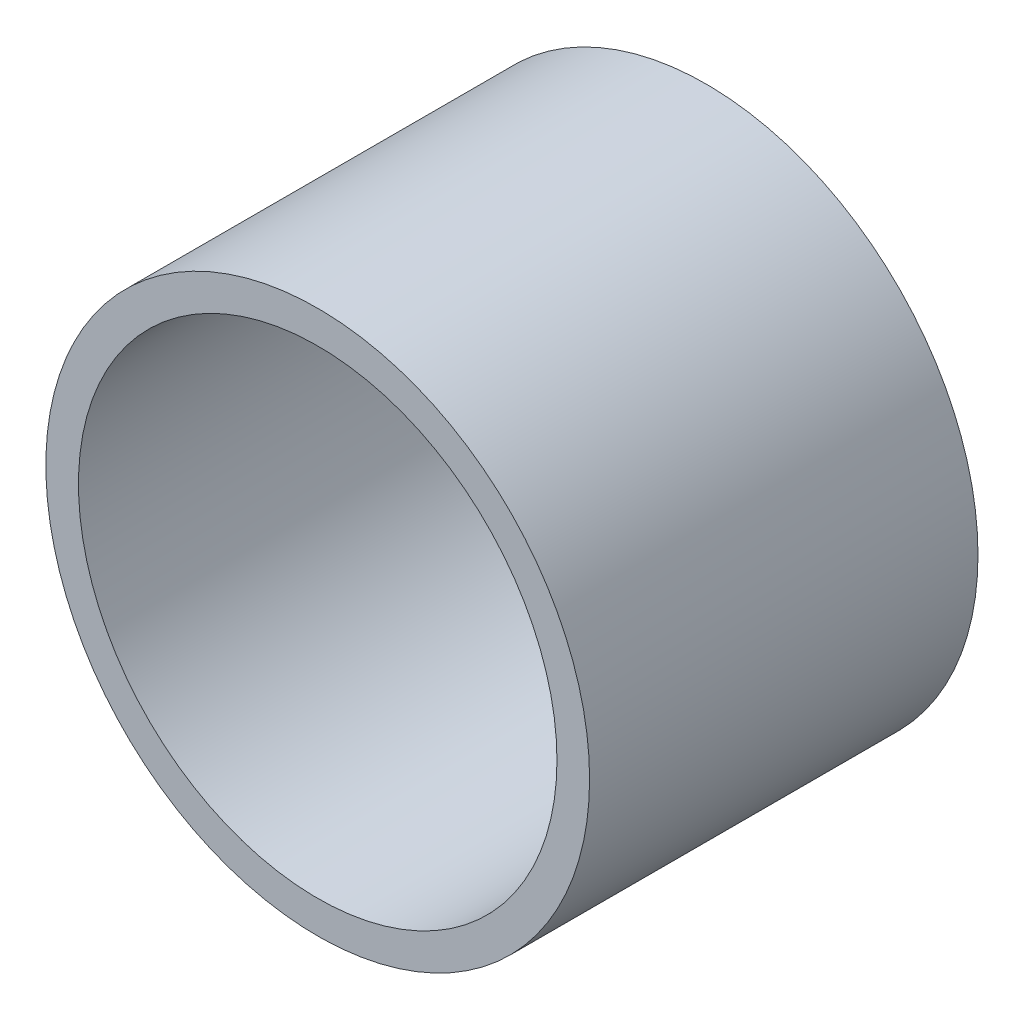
ISO-10303-21;
HEADER;
FILE_DESCRIPTION(('STEP AP214'),'2;1');
FILE_NAME('part.step','',(''),(''),'','','');
FILE_SCHEMA(('AUTOMOTIVE_DESIGN { 1 0 10303 214 1 1 1 1 }'));
ENDSEC;
DATA;
#1=APPLICATION_CONTEXT('core data for automotive mechanical design processes');
#2=APPLICATION_PROTOCOL_DEFINITION('international standard','automotive_design',2000,#1);
#3=PRODUCT_CONTEXT('',#1,'mechanical');
#4=PRODUCT('Part','Part','',(#3));
#5=PRODUCT_RELATED_PRODUCT_CATEGORY('part','',(#4));
#6=PRODUCT_DEFINITION_FORMATION('','',#4);
#7=PRODUCT_DEFINITION_CONTEXT('part definition',#1,'design');
#8=PRODUCT_DEFINITION('design','',#6,#7);
#9=PRODUCT_DEFINITION_SHAPE('','',#8);
#10=(LENGTH_UNIT() NAMED_UNIT(*) SI_UNIT(.MILLI.,.METRE.));
#11=(NAMED_UNIT(*) PLANE_ANGLE_UNIT() SI_UNIT($,.RADIAN.));
#12=(NAMED_UNIT(*) SI_UNIT($,.STERADIAN.) SOLID_ANGLE_UNIT());
#13=UNCERTAINTY_MEASURE_WITH_UNIT(LENGTH_MEASURE(1.E-05),#10,'distance_accuracy_value','');
#14=(GEOMETRIC_REPRESENTATION_CONTEXT(3) GLOBAL_UNCERTAINTY_ASSIGNED_CONTEXT((#13)) GLOBAL_UNIT_ASSIGNED_CONTEXT((#10,
#11,#12)) REPRESENTATION_CONTEXT('',''));
#15=CARTESIAN_POINT('',(0.,0.,0.));
#16=DIRECTION('',(0.,0.,1.));
#17=DIRECTION('',(1.,0.,0.));
#18=AXIS2_PLACEMENT_3D('',#15,#16,#17);
#19=CARTESIAN_POINT('',(0.,0.,6.35));
#20=DIRECTION('',(0.,0.,1.));
#21=DIRECTION('',(1.,0.,0.));
#22=AXIS2_PLACEMENT_3D('',#19,#20,#21);
#23=PLANE('',#22);
#24=CARTESIAN_POINT('',(0.,0.,6.35));
#25=DIRECTION('',(0.,0.,1.));
#26=DIRECTION('',(1.,0.,0.));
#27=AXIS2_PLACEMENT_3D('',#24,#25,#26);
#28=CIRCLE('',#27,4.445);
#29=CARTESIAN_POINT('',(4.445,0.,6.35));
#30=VERTEX_POINT('',#29);
#31=EDGE_CURVE('E10',#30,#30,#28,.T.);
#32=ORIENTED_EDGE('',*,*,#31,.T.);
#33=EDGE_LOOP('',(#32));
#34=FACE_BOUND('',#33,.T.);
#35=CARTESIAN_POINT('',(0.,0.,6.35));
#36=DIRECTION('',(0.,0.,1.));
#37=DIRECTION('',(1.,0.,0.));
#38=AXIS2_PLACEMENT_3D('',#35,#36,#37);
#39=CIRCLE('',#38,3.9116);
#40=CARTESIAN_POINT('',(3.9116,0.,6.35));
#41=VERTEX_POINT('',#40);
#42=EDGE_CURVE('E41',#41,#41,#39,.T.);
#43=ORIENTED_EDGE('',*,*,#42,.F.);
#44=EDGE_LOOP('',(#43));
#45=FACE_BOUND('',#44,.T.);
#46=ADVANCED_FACE('F30',(#34,#45),#23,.T.);
#47=CARTESIAN_POINT('',(0.,0.,0.));
#48=DIRECTION('',(0.,0.,1.));
#49=DIRECTION('',(1.,0.,0.));
#50=AXIS2_PLACEMENT_3D('',#47,#48,#49);
#51=PLANE('',#50);
#52=CARTESIAN_POINT('',(0.,0.,0.));
#53=DIRECTION('',(0.,0.,1.));
#54=DIRECTION('',(1.,0.,0.));
#55=AXIS2_PLACEMENT_3D('',#52,#53,#54);
#56=CIRCLE('',#55,4.445);
#57=CARTESIAN_POINT('',(4.445,0.,0.));
#58=VERTEX_POINT('',#57);
#59=EDGE_CURVE('E34',#58,#58,#56,.T.);
#60=ORIENTED_EDGE('',*,*,#59,.F.);
#61=EDGE_LOOP('',(#60));
#62=FACE_BOUND('',#61,.T.);
#63=CARTESIAN_POINT('',(0.,0.,0.));
#64=DIRECTION('',(0.,0.,1.));
#65=DIRECTION('',(1.,0.,0.));
#66=AXIS2_PLACEMENT_3D('',#63,#64,#65);
#67=CIRCLE('',#66,3.9116);
#68=CARTESIAN_POINT('',(3.9116,0.,0.));
#69=VERTEX_POINT('',#68);
#70=EDGE_CURVE('E43',#69,#69,#67,.T.);
#71=ORIENTED_EDGE('',*,*,#70,.T.);
#72=EDGE_LOOP('',(#71));
#73=FACE_BOUND('',#72,.T.);
#74=ADVANCED_FACE('F53',(#62,#73),#51,.F.);
#75=CARTESIAN_POINT('',(0.,0.,6.35));
#76=DIRECTION('',(0.,0.,-1.));
#77=DIRECTION('',(-1.,0.,0.));
#78=AXIS2_PLACEMENT_3D('',#75,#76,#77);
#79=CYLINDRICAL_SURFACE('',#78,4.445);
#80=ORIENTED_EDGE('',*,*,#31,.F.);
#81=EDGE_LOOP('',(#80));
#82=FACE_BOUND('',#81,.T.);
#83=ORIENTED_EDGE('',*,*,#59,.T.);
#84=EDGE_LOOP('',(#83));
#85=FACE_BOUND('',#84,.T.);
#86=ADVANCED_FACE('F32',(#82,#85),#79,.T.);
#87=CARTESIAN_POINT('',(0.,0.,6.35));
#88=DIRECTION('',(0.,0.,-1.));
#89=DIRECTION('',(-1.,0.,0.));
#90=AXIS2_PLACEMENT_3D('',#87,#88,#89);
#91=CYLINDRICAL_SURFACE('',#90,3.9116);
#92=ORIENTED_EDGE('',*,*,#42,.T.);
#93=EDGE_LOOP('',(#92));
#94=FACE_BOUND('',#93,.T.);
#95=ORIENTED_EDGE('',*,*,#70,.F.);
#96=EDGE_LOOP('',(#95));
#97=FACE_BOUND('',#96,.T.);
#98=ADVANCED_FACE('F49',(#94,#97),#91,.F.);
#99=CLOSED_SHELL('',(#46,#74,#86,#98));
#100=MANIFOLD_SOLID_BREP('B2',#99);
#101=ADVANCED_BREP_SHAPE_REPRESENTATION('',(#18,#100),#14);
#102=SHAPE_DEFINITION_REPRESENTATION(#9,#101);
ENDSEC;
END-ISO-10303-21;
